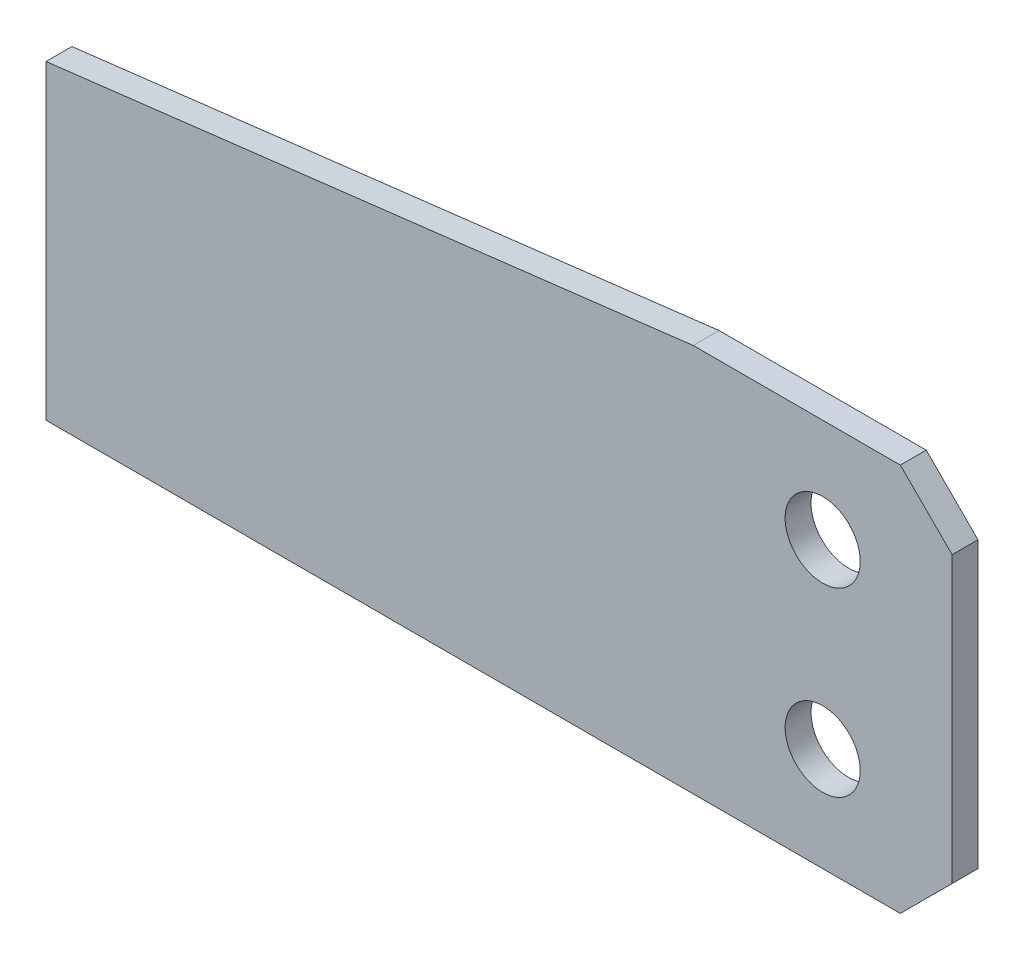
ISO-10303-21;
HEADER;
FILE_DESCRIPTION(('STEP AP214'),'2;1');
FILE_NAME('part.step','',(''),(''),'','','');
FILE_SCHEMA(('AUTOMOTIVE_DESIGN { 1 0 10303 214 1 1 1 1 }'));
ENDSEC;
DATA;
#1=APPLICATION_CONTEXT('core data for automotive mechanical design processes');
#2=APPLICATION_PROTOCOL_DEFINITION('international standard','automotive_design',2000,#1);
#3=PRODUCT_CONTEXT('',#1,'mechanical');
#4=PRODUCT('Part','Part','',(#3));
#5=PRODUCT_RELATED_PRODUCT_CATEGORY('part','',(#4));
#6=PRODUCT_DEFINITION_FORMATION('','',#4);
#7=PRODUCT_DEFINITION_CONTEXT('part definition',#1,'design');
#8=PRODUCT_DEFINITION('design','',#6,#7);
#9=PRODUCT_DEFINITION_SHAPE('','',#8);
#10=(LENGTH_UNIT() NAMED_UNIT(*) SI_UNIT(.MILLI.,.METRE.));
#11=(NAMED_UNIT(*) PLANE_ANGLE_UNIT() SI_UNIT($,.RADIAN.));
#12=(NAMED_UNIT(*) SI_UNIT($,.STERADIAN.) SOLID_ANGLE_UNIT());
#13=UNCERTAINTY_MEASURE_WITH_UNIT(LENGTH_MEASURE(1.E-05),#10,'distance_accuracy_value','');
#14=(GEOMETRIC_REPRESENTATION_CONTEXT(3) GLOBAL_UNCERTAINTY_ASSIGNED_CONTEXT((#13)) GLOBAL_UNIT_ASSIGNED_CONTEXT((#10,
#11,#12)) REPRESENTATION_CONTEXT('',''));
#15=CARTESIAN_POINT('',(0.,0.,0.));
#16=DIRECTION('',(0.,0.,1.));
#17=DIRECTION('',(1.,0.,0.));
#18=AXIS2_PLACEMENT_3D('',#15,#16,#17);
#19=CARTESIAN_POINT('',(-350.,-150.,10.));
#20=DIRECTION('',(0.,0.,-1.));
#21=DIRECTION('',(-1.,0.,0.));
#22=AXIS2_PLACEMENT_3D('',#19,#20,#21);
#23=PLANE('',#22);
#24=CARTESIAN_POINT('',(-50.,-40.,10.));
#25=DIRECTION('',(0.,0.,1.));
#26=DIRECTION('',(1.,0.,0.));
#27=AXIS2_PLACEMENT_3D('',#24,#25,#26);
#28=CIRCLE('',#27,14.5);
#29=CARTESIAN_POINT('',(-35.5,-40.,10.));
#30=VERTEX_POINT('',#29);
#31=EDGE_CURVE('E107',#30,#30,#28,.T.);
#32=ORIENTED_EDGE('',*,*,#31,.F.);
#33=EDGE_LOOP('',(#32));
#34=FACE_BOUND('',#33,.T.);
#35=DIRECTION('',(0.,-1.,0.));
#36=VECTOR('',#35,1.);
#37=CARTESIAN_POINT('',(-350.,-30.0000000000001,10.));
#38=LINE('',#37,#36);
#39=CARTESIAN_POINT('',(-350.,-30.0000000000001,10.));
#40=VERTEX_POINT('',#39);
#41=CARTESIAN_POINT('',(-350.,-150.,10.));
#42=VERTEX_POINT('',#41);
#43=EDGE_CURVE('E123',#40,#42,#38,.T.);
#44=ORIENTED_EDGE('',*,*,#43,.T.);
#45=DIRECTION('',(1.,0.,0.));
#46=VECTOR('',#45,1.);
#47=CARTESIAN_POINT('',(-20.,-150.,10.));
#48=LINE('',#47,#46);
#49=CARTESIAN_POINT('',(-20.,-150.,10.));
#50=VERTEX_POINT('',#49);
#51=EDGE_CURVE('E102',#42,#50,#48,.T.);
#52=ORIENTED_EDGE('',*,*,#51,.T.);
#53=DIRECTION('',(0.707106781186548,0.707106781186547,0.));
#54=VECTOR('',#53,1.);
#55=CARTESIAN_POINT('',(0.,-130.,10.));
#56=LINE('',#55,#54);
#57=CARTESIAN_POINT('',(0.,-130.,10.));
#58=VERTEX_POINT('',#57);
#59=EDGE_CURVE('E126',#50,#58,#56,.T.);
#60=ORIENTED_EDGE('',*,*,#59,.T.);
#61=DIRECTION('',(0.,1.,0.));
#62=VECTOR('',#61,1.);
#63=CARTESIAN_POINT('',(0.,-19.9999999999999,10.));
#64=LINE('',#63,#62);
#65=CARTESIAN_POINT('',(0.,-19.9999999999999,10.));
#66=VERTEX_POINT('',#65);
#67=EDGE_CURVE('E128',#58,#66,#64,.T.);
#68=ORIENTED_EDGE('',*,*,#67,.T.);
#69=DIRECTION('',(-0.707106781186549,0.707106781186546,0.));
#70=VECTOR('',#69,1.);
#71=CARTESIAN_POINT('',(0.,-19.9999999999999,10.));
#72=LINE('',#71,#70);
#73=CARTESIAN_POINT('',(-20.,0.,10.));
#74=VERTEX_POINT('',#73);
#75=EDGE_CURVE('E130',#66,#74,#72,.T.);
#76=ORIENTED_EDGE('',*,*,#75,.T.);
#77=DIRECTION('',(-1.,0.,0.));
#78=VECTOR('',#77,1.);
#79=CARTESIAN_POINT('',(-20.,0.,10.));
#80=LINE('',#79,#78);
#81=CARTESIAN_POINT('',(-100.,0.,10.));
#82=VERTEX_POINT('',#81);
#83=EDGE_CURVE('E49',#74,#82,#80,.T.);
#84=ORIENTED_EDGE('',*,*,#83,.T.);
#85=DIRECTION('',(-0.992876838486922,-0.119145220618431,0.));
#86=VECTOR('',#85,1.);
#87=CARTESIAN_POINT('',(-100.,0.,10.));
#88=LINE('',#87,#86);
#89=EDGE_CURVE('E44',#82,#40,#88,.T.);
#90=ORIENTED_EDGE('',*,*,#89,.T.);
#91=EDGE_LOOP('',(#44,#52,#60,#68,#76,#84,#90));
#92=FACE_BOUND('',#91,.T.);
#93=CARTESIAN_POINT('',(-50.,-110.,10.));
#94=DIRECTION('',(0.,0.,1.));
#95=DIRECTION('',(1.,0.,0.));
#96=AXIS2_PLACEMENT_3D('',#93,#94,#95);
#97=CIRCLE('',#96,14.5);
#98=CARTESIAN_POINT('',(-35.5,-110.,10.));
#99=VERTEX_POINT('',#98);
#100=EDGE_CURVE('E193',#99,#99,#97,.T.);
#101=ORIENTED_EDGE('',*,*,#100,.F.);
#102=EDGE_LOOP('',(#101));
#103=FACE_BOUND('',#102,.T.);
#104=ADVANCED_FACE('F29',(#34,#92,#103),#23,.F.);
#105=CARTESIAN_POINT('',(-350.,-150.,0.));
#106=DIRECTION('',(0.,0.,-1.));
#107=DIRECTION('',(-1.,0.,0.));
#108=AXIS2_PLACEMENT_3D('',#105,#106,#107);
#109=PLANE('',#108);
#110=CARTESIAN_POINT('',(-50.,-40.,0.));
#111=DIRECTION('',(0.,0.,1.));
#112=DIRECTION('',(1.,0.,0.));
#113=AXIS2_PLACEMENT_3D('',#110,#111,#112);
#114=CIRCLE('',#113,14.5);
#115=CARTESIAN_POINT('',(-35.5,-40.,0.));
#116=VERTEX_POINT('',#115);
#117=EDGE_CURVE('E110',#116,#116,#114,.T.);
#118=ORIENTED_EDGE('',*,*,#117,.T.);
#119=EDGE_LOOP('',(#118));
#120=FACE_BOUND('',#119,.T.);
#121=DIRECTION('',(0.,-1.,0.));
#122=VECTOR('',#121,1.);
#123=CARTESIAN_POINT('',(-350.,-30.0000000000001,0.));
#124=LINE('',#123,#122);
#125=CARTESIAN_POINT('',(-350.,-30.0000000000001,0.));
#126=VERTEX_POINT('',#125);
#127=CARTESIAN_POINT('',(-350.,-150.,0.));
#128=VERTEX_POINT('',#127);
#129=EDGE_CURVE('E93',#126,#128,#124,.T.);
#130=ORIENTED_EDGE('',*,*,#129,.F.);
#131=DIRECTION('',(-0.992876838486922,-0.119145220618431,0.));
#132=VECTOR('',#131,1.);
#133=CARTESIAN_POINT('',(-100.,0.,0.));
#134=LINE('',#133,#132);
#135=CARTESIAN_POINT('',(-100.,0.,0.));
#136=VERTEX_POINT('',#135);
#137=EDGE_CURVE('E121',#136,#126,#134,.T.);
#138=ORIENTED_EDGE('',*,*,#137,.F.);
#139=DIRECTION('',(-1.,0.,0.));
#140=VECTOR('',#139,1.);
#141=CARTESIAN_POINT('',(-20.,0.,0.));
#142=LINE('',#141,#140);
#143=CARTESIAN_POINT('',(-20.,0.,0.));
#144=VERTEX_POINT('',#143);
#145=EDGE_CURVE('E119',#144,#136,#142,.T.);
#146=ORIENTED_EDGE('',*,*,#145,.F.);
#147=DIRECTION('',(-0.707106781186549,0.707106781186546,0.));
#148=VECTOR('',#147,1.);
#149=CARTESIAN_POINT('',(0.,-19.9999999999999,0.));
#150=LINE('',#149,#148);
#151=CARTESIAN_POINT('',(0.,-19.9999999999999,0.));
#152=VERTEX_POINT('',#151);
#153=EDGE_CURVE('E117',#152,#144,#150,.T.);
#154=ORIENTED_EDGE('',*,*,#153,.F.);
#155=DIRECTION('',(0.,1.,0.));
#156=VECTOR('',#155,1.);
#157=CARTESIAN_POINT('',(0.,-19.9999999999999,0.));
#158=LINE('',#157,#156);
#159=CARTESIAN_POINT('',(0.,-130.,0.));
#160=VERTEX_POINT('',#159);
#161=EDGE_CURVE('E115',#160,#152,#158,.T.);
#162=ORIENTED_EDGE('',*,*,#161,.F.);
#163=DIRECTION('',(0.707106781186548,0.707106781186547,0.));
#164=VECTOR('',#163,1.);
#165=CARTESIAN_POINT('',(0.,-130.,0.));
#166=LINE('',#165,#164);
#167=CARTESIAN_POINT('',(-20.,-150.,0.));
#168=VERTEX_POINT('',#167);
#169=EDGE_CURVE('E95',#168,#160,#166,.T.);
#170=ORIENTED_EDGE('',*,*,#169,.F.);
#171=DIRECTION('',(1.,0.,0.));
#172=VECTOR('',#171,1.);
#173=CARTESIAN_POINT('',(-20.,-150.,0.));
#174=LINE('',#173,#172);
#175=EDGE_CURVE('E88',#128,#168,#174,.T.);
#176=ORIENTED_EDGE('',*,*,#175,.F.);
#177=EDGE_LOOP('',(#130,#138,#146,#154,#162,#170,#176));
#178=FACE_BOUND('',#177,.T.);
#179=CARTESIAN_POINT('',(-50.,-110.,0.));
#180=DIRECTION('',(0.,0.,1.));
#181=DIRECTION('',(1.,0.,0.));
#182=AXIS2_PLACEMENT_3D('',#179,#180,#181);
#183=CIRCLE('',#182,14.5);
#184=CARTESIAN_POINT('',(-35.5,-110.,0.));
#185=VERTEX_POINT('',#184);
#186=EDGE_CURVE('E196',#185,#185,#183,.T.);
#187=ORIENTED_EDGE('',*,*,#186,.T.);
#188=EDGE_LOOP('',(#187));
#189=FACE_BOUND('',#188,.T.);
#190=ADVANCED_FACE('F89',(#120,#178,#189),#109,.T.);
#191=CARTESIAN_POINT('',(-350.,-30.0000000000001,10.));
#192=DIRECTION('',(1.,0.,0.));
#193=DIRECTION('',(0.,0.,-1.));
#194=AXIS2_PLACEMENT_3D('',#191,#192,#193);
#195=PLANE('',#194);
#196=ORIENTED_EDGE('',*,*,#129,.T.);
#197=DIRECTION('',(0.,0.,-1.));
#198=VECTOR('',#197,1.);
#199=CARTESIAN_POINT('',(-350.,-150.,10.));
#200=LINE('',#199,#198);
#201=EDGE_CURVE('E11',#42,#128,#200,.T.);
#202=ORIENTED_EDGE('',*,*,#201,.F.);
#203=ORIENTED_EDGE('',*,*,#43,.F.);
#204=DIRECTION('',(0.,0.,-1.));
#205=VECTOR('',#204,1.);
#206=CARTESIAN_POINT('',(-350.,-30.0000000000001,10.));
#207=LINE('',#206,#205);
#208=EDGE_CURVE('E106',#40,#126,#207,.T.);
#209=ORIENTED_EDGE('',*,*,#208,.T.);
#210=EDGE_LOOP('',(#196,#202,#203,#209));
#211=FACE_BOUND('',#210,.T.);
#212=ADVANCED_FACE('F31',(#211),#195,.F.);
#213=CARTESIAN_POINT('',(-20.,-150.,10.));
#214=DIRECTION('',(0.,1.,0.));
#215=DIRECTION('',(-1.,0.,0.));
#216=AXIS2_PLACEMENT_3D('',#213,#214,#215);
#217=PLANE('',#216);
#218=ORIENTED_EDGE('',*,*,#175,.T.);
#219=DIRECTION('',(0.,0.,-1.));
#220=VECTOR('',#219,1.);
#221=CARTESIAN_POINT('',(-20.,-150.,10.));
#222=LINE('',#221,#220);
#223=EDGE_CURVE('E37',#50,#168,#222,.T.);
#224=ORIENTED_EDGE('',*,*,#223,.F.);
#225=ORIENTED_EDGE('',*,*,#51,.F.);
#226=ORIENTED_EDGE('',*,*,#201,.T.);
#227=EDGE_LOOP('',(#218,#224,#225,#226));
#228=FACE_BOUND('',#227,.T.);
#229=ADVANCED_FACE('F101',(#228),#217,.F.);
#230=CARTESIAN_POINT('',(0.,-130.,10.));
#231=DIRECTION('',(-0.707106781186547,0.707106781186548,0.));
#232=DIRECTION('',(-0.707106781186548,-0.707106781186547,0.));
#233=AXIS2_PLACEMENT_3D('',#230,#231,#232);
#234=PLANE('',#233);
#235=ORIENTED_EDGE('',*,*,#169,.T.);
#236=DIRECTION('',(0.,0.,-1.));
#237=VECTOR('',#236,1.);
#238=CARTESIAN_POINT('',(0.,-130.,10.));
#239=LINE('',#238,#237);
#240=EDGE_CURVE('E144',#58,#160,#239,.T.);
#241=ORIENTED_EDGE('',*,*,#240,.F.);
#242=ORIENTED_EDGE('',*,*,#59,.F.);
#243=ORIENTED_EDGE('',*,*,#223,.T.);
#244=EDGE_LOOP('',(#235,#241,#242,#243));
#245=FACE_BOUND('',#244,.T.);
#246=ADVANCED_FACE('F148',(#245),#234,.F.);
#247=CARTESIAN_POINT('',(0.,-19.9999999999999,10.));
#248=DIRECTION('',(-1.,0.,0.));
#249=DIRECTION('',(0.,-1.,0.));
#250=AXIS2_PLACEMENT_3D('',#247,#248,#249);
#251=PLANE('',#250);
#252=ORIENTED_EDGE('',*,*,#161,.T.);
#253=DIRECTION('',(0.,0.,-1.));
#254=VECTOR('',#253,1.);
#255=CARTESIAN_POINT('',(0.,-19.9999999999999,10.));
#256=LINE('',#255,#254);
#257=EDGE_CURVE('E141',#66,#152,#256,.T.);
#258=ORIENTED_EDGE('',*,*,#257,.F.);
#259=ORIENTED_EDGE('',*,*,#67,.F.);
#260=ORIENTED_EDGE('',*,*,#240,.T.);
#261=EDGE_LOOP('',(#252,#258,#259,#260));
#262=FACE_BOUND('',#261,.T.);
#263=ADVANCED_FACE('F156',(#262),#251,.F.);
#264=CARTESIAN_POINT('',(0.,-19.9999999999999,10.));
#265=DIRECTION('',(-0.707106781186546,-0.707106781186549,0.));
#266=DIRECTION('',(0.707106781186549,-0.707106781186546,0.));
#267=AXIS2_PLACEMENT_3D('',#264,#265,#266);
#268=PLANE('',#267);
#269=ORIENTED_EDGE('',*,*,#153,.T.);
#270=DIRECTION('',(0.,0.,-1.));
#271=VECTOR('',#270,1.);
#272=CARTESIAN_POINT('',(-20.,0.,10.));
#273=LINE('',#272,#271);
#274=EDGE_CURVE('E138',#74,#144,#273,.T.);
#275=ORIENTED_EDGE('',*,*,#274,.F.);
#276=ORIENTED_EDGE('',*,*,#75,.F.);
#277=ORIENTED_EDGE('',*,*,#257,.T.);
#278=EDGE_LOOP('',(#269,#275,#276,#277));
#279=FACE_BOUND('',#278,.T.);
#280=ADVANCED_FACE('F159',(#279),#268,.F.);
#281=CARTESIAN_POINT('',(-20.,0.,10.));
#282=DIRECTION('',(0.,-1.,0.));
#283=DIRECTION('',(1.,0.,0.));
#284=AXIS2_PLACEMENT_3D('',#281,#282,#283);
#285=PLANE('',#284);
#286=ORIENTED_EDGE('',*,*,#145,.T.);
#287=DIRECTION('',(0.,0.,-1.));
#288=VECTOR('',#287,1.);
#289=CARTESIAN_POINT('',(-100.,0.,10.));
#290=LINE('',#289,#288);
#291=EDGE_CURVE('E135',#82,#136,#290,.T.);
#292=ORIENTED_EDGE('',*,*,#291,.F.);
#293=ORIENTED_EDGE('',*,*,#83,.F.);
#294=ORIENTED_EDGE('',*,*,#274,.T.);
#295=EDGE_LOOP('',(#286,#292,#293,#294));
#296=FACE_BOUND('',#295,.T.);
#297=ADVANCED_FACE('F162',(#296),#285,.F.);
#298=CARTESIAN_POINT('',(-100.,0.,10.));
#299=DIRECTION('',(0.119145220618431,-0.992876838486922,0.));
#300=DIRECTION('',(0.992876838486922,0.119145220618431,0.));
#301=AXIS2_PLACEMENT_3D('',#298,#299,#300);
#302=PLANE('',#301);
#303=ORIENTED_EDGE('',*,*,#137,.T.);
#304=ORIENTED_EDGE('',*,*,#208,.F.);
#305=ORIENTED_EDGE('',*,*,#89,.F.);
#306=ORIENTED_EDGE('',*,*,#291,.T.);
#307=EDGE_LOOP('',(#303,#304,#305,#306));
#308=FACE_BOUND('',#307,.T.);
#309=ADVANCED_FACE('F164',(#308),#302,.F.);
#310=CARTESIAN_POINT('',(-50.,-40.,10.));
#311=DIRECTION('',(0.,0.,-1.));
#312=DIRECTION('',(-1.,0.,0.));
#313=AXIS2_PLACEMENT_3D('',#310,#311,#312);
#314=CYLINDRICAL_SURFACE('',#313,14.5);
#315=ORIENTED_EDGE('',*,*,#31,.T.);
#316=EDGE_LOOP('',(#315));
#317=FACE_BOUND('',#316,.T.);
#318=ORIENTED_EDGE('',*,*,#117,.F.);
#319=EDGE_LOOP('',(#318));
#320=FACE_BOUND('',#319,.T.);
#321=ADVANCED_FACE('F166',(#317,#320),#314,.F.);
#322=CARTESIAN_POINT('',(-50.,-110.,10.));
#323=DIRECTION('',(0.,0.,-1.));
#324=DIRECTION('',(-1.,0.,0.));
#325=AXIS2_PLACEMENT_3D('',#322,#323,#324);
#326=CYLINDRICAL_SURFACE('',#325,14.5);
#327=ORIENTED_EDGE('',*,*,#100,.T.);
#328=EDGE_LOOP('',(#327));
#329=FACE_BOUND('',#328,.T.);
#330=ORIENTED_EDGE('',*,*,#186,.F.);
#331=EDGE_LOOP('',(#330));
#332=FACE_BOUND('',#331,.T.);
#333=ADVANCED_FACE('F172',(#329,#332),#326,.F.);
#334=CLOSED_SHELL('',(#104,#190,#212,#229,#246,#263,#280,#297,#309,#321,#333));
#335=MANIFOLD_SOLID_BREP('B2',#334);
#336=ADVANCED_BREP_SHAPE_REPRESENTATION('',(#18,#335),#14);
#337=SHAPE_DEFINITION_REPRESENTATION(#9,#336);
ENDSEC;
END-ISO-10303-21;
